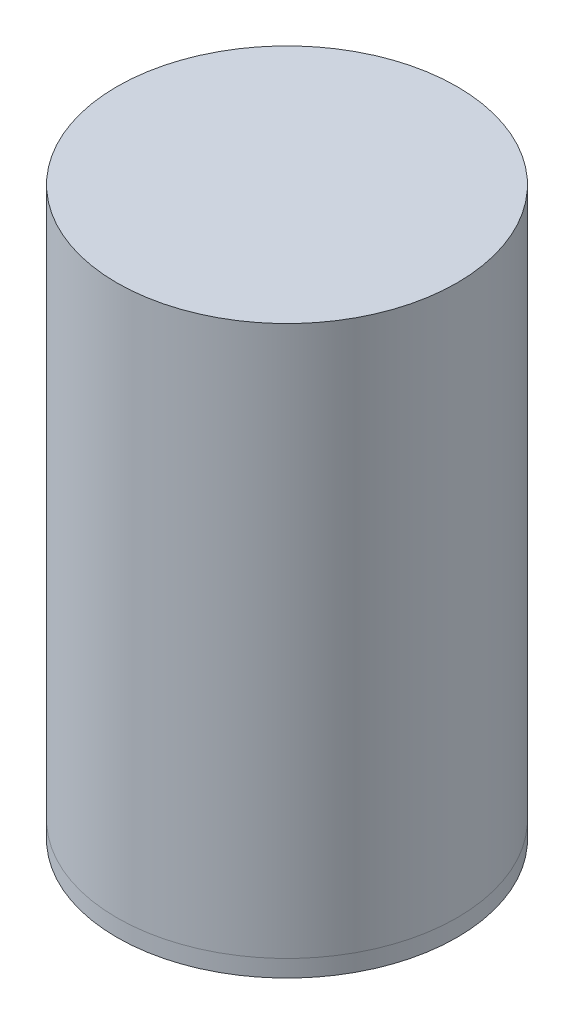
ISO-10303-21;
HEADER;
FILE_DESCRIPTION(('STEP AP214'),'2;1');
FILE_NAME('part.step','',(''),(''),'','','');
FILE_SCHEMA(('AUTOMOTIVE_DESIGN { 1 0 10303 214 1 1 1 1 }'));
ENDSEC;
DATA;
#1=APPLICATION_CONTEXT('core data for automotive mechanical design processes');
#2=APPLICATION_PROTOCOL_DEFINITION('international standard','automotive_design',2000,#1);
#3=PRODUCT_CONTEXT('',#1,'mechanical');
#4=PRODUCT('Part','Part','',(#3));
#5=PRODUCT_RELATED_PRODUCT_CATEGORY('part','',(#4));
#6=PRODUCT_DEFINITION_FORMATION('','',#4);
#7=PRODUCT_DEFINITION_CONTEXT('part definition',#1,'design');
#8=PRODUCT_DEFINITION('design','',#6,#7);
#9=PRODUCT_DEFINITION_SHAPE('','',#8);
#10=(LENGTH_UNIT() NAMED_UNIT(*) SI_UNIT(.MILLI.,.METRE.));
#11=(NAMED_UNIT(*) PLANE_ANGLE_UNIT() SI_UNIT($,.RADIAN.));
#12=(NAMED_UNIT(*) SI_UNIT($,.STERADIAN.) SOLID_ANGLE_UNIT());
#13=UNCERTAINTY_MEASURE_WITH_UNIT(LENGTH_MEASURE(1.E-05),#10,'distance_accuracy_value','');
#14=(GEOMETRIC_REPRESENTATION_CONTEXT(3) GLOBAL_UNCERTAINTY_ASSIGNED_CONTEXT((#13)) GLOBAL_UNIT_ASSIGNED_CONTEXT((#10,
#11,#12)) REPRESENTATION_CONTEXT('',''));
#15=CARTESIAN_POINT('',(0.,0.,0.));
#16=DIRECTION('',(0.,0.,1.));
#17=DIRECTION('',(1.,0.,0.));
#18=AXIS2_PLACEMENT_3D('',#15,#16,#17);
#19=CARTESIAN_POINT('',(0.,-93.,0.));
#20=DIRECTION('',(0.,-1.,0.));
#21=DIRECTION('',(1.,0.,0.));
#22=AXIS2_PLACEMENT_3D('',#19,#20,#21);
#23=CYLINDRICAL_SURFACE('',#22,18.);
#24=CARTESIAN_POINT('',(0.,-93.,0.));
#25=DIRECTION('',(0.,-1.,0.));
#26=DIRECTION('',(1.,0.,0.));
#27=AXIS2_PLACEMENT_3D('',#24,#25,#26);
#28=CIRCLE('',#27,18.);
#29=CARTESIAN_POINT('',(18.0000000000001,-93.,0.));
#30=VERTEX_POINT('',#29);
#31=EDGE_CURVE('E11',#30,#30,#28,.T.);
#32=ORIENTED_EDGE('',*,*,#31,.T.);
#33=EDGE_LOOP('',(#32));
#34=FACE_BOUND('',#33,.T.);
#35=CARTESIAN_POINT('',(1.00723583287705E-13,-94.,0.));
#36=DIRECTION('',(0.,-1.,0.));
#37=DIRECTION('',(1.,0.,0.));
#38=AXIS2_PLACEMENT_3D('',#35,#36,#37);
#39=CIRCLE('',#38,18.);
#40=CARTESIAN_POINT('',(18.0000000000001,-94.,0.));
#41=VERTEX_POINT('',#40);
#42=EDGE_CURVE('E52',#41,#41,#39,.T.);
#43=ORIENTED_EDGE('',*,*,#42,.F.);
#44=EDGE_LOOP('',(#43));
#45=FACE_BOUND('',#44,.T.);
#46=ADVANCED_FACE('F49',(#34,#45),#23,.T.);
#47=CARTESIAN_POINT('',(0.,-93.,0.));
#48=DIRECTION('',(0.,-1.,0.));
#49=DIRECTION('',(1.,0.,0.));
#50=AXIS2_PLACEMENT_3D('',#47,#48,#49);
#51=PLANE('',#50);
#52=ORIENTED_EDGE('',*,*,#31,.F.);
#53=EDGE_LOOP('',(#52));
#54=FACE_BOUND('',#53,.T.);
#55=ADVANCED_FACE('F64',(#54),#51,.F.);
#56=CARTESIAN_POINT('',(1.00723583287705E-13,-94.,0.));
#57=DIRECTION('',(0.,-1.,0.));
#58=DIRECTION('',(1.,0.,0.));
#59=AXIS2_PLACEMENT_3D('',#56,#57,#58);
#60=PLANE('',#59);
#61=ORIENTED_EDGE('',*,*,#42,.T.);
#62=EDGE_LOOP('',(#61));
#63=FACE_BOUND('',#62,.T.);
#64=ADVANCED_FACE('F61',(#63),#60,.T.);
#65=CLOSED_SHELL('',(#46,#55,#64));
#66=MANIFOLD_SOLID_BREP('B2',#65);
#67=CARTESIAN_POINT('',(0.,-91.,0.));
#68=DIRECTION('',(0.,1.,0.));
#69=DIRECTION('',(-1.,0.,0.));
#70=AXIS2_PLACEMENT_3D('',#67,#68,#69);
#71=PLANE('',#70);
#72=CARTESIAN_POINT('',(0.,-91.,0.));
#73=DIRECTION('',(0.,1.,0.));
#74=DIRECTION('',(-1.,0.,0.));
#75=AXIS2_PLACEMENT_3D('',#72,#73,#74);
#76=CIRCLE('',#75,25.);
#77=CARTESIAN_POINT('',(-24.9999999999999,-91.,0.));
#78=VERTEX_POINT('',#77);
#79=EDGE_CURVE('E48',#78,#78,#76,.T.);
#80=ORIENTED_EDGE('',*,*,#79,.T.);
#81=EDGE_LOOP('',(#80));
#82=FACE_BOUND('',#81,.T.);
#83=CARTESIAN_POINT('',(0.,-91.,0.));
#84=DIRECTION('',(0.,1.,0.));
#85=DIRECTION('',(-1.,0.,0.));
#86=AXIS2_PLACEMENT_3D('',#83,#84,#85);
#87=CIRCLE('',#86,18.);
#88=CARTESIAN_POINT('',(-17.9999999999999,-91.,0.));
#89=VERTEX_POINT('',#88);
#90=EDGE_CURVE('E108',#89,#89,#87,.T.);
#91=ORIENTED_EDGE('',*,*,#90,.F.);
#92=EDGE_LOOP('',(#91));
#93=FACE_BOUND('',#92,.T.);
#94=ADVANCED_FACE('F97',(#82,#93),#71,.T.);
#95=CARTESIAN_POINT('',(1.00723583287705E-13,-94.,0.));
#96=DIRECTION('',(0.,1.,0.));
#97=DIRECTION('',(-1.,0.,0.));
#98=AXIS2_PLACEMENT_3D('',#95,#96,#97);
#99=PLANE('',#98);
#100=CARTESIAN_POINT('',(1.00723583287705E-13,-94.,0.));
#101=DIRECTION('',(0.,1.,0.));
#102=DIRECTION('',(-1.,0.,0.));
#103=AXIS2_PLACEMENT_3D('',#100,#101,#102);
#104=CIRCLE('',#103,25.);
#105=CARTESIAN_POINT('',(-24.9999999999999,-94.,0.));
#106=VERTEX_POINT('',#105);
#107=EDGE_CURVE('E101',#106,#106,#104,.T.);
#108=ORIENTED_EDGE('',*,*,#107,.F.);
#109=EDGE_LOOP('',(#108));
#110=FACE_BOUND('',#109,.T.);
#111=CARTESIAN_POINT('',(1.00723583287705E-13,-94.,0.));
#112=DIRECTION('',(0.,1.,0.));
#113=DIRECTION('',(-1.,0.,0.));
#114=AXIS2_PLACEMENT_3D('',#111,#112,#113);
#115=CIRCLE('',#114,18.);
#116=CARTESIAN_POINT('',(-17.9999999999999,-94.,0.));
#117=VERTEX_POINT('',#116);
#118=EDGE_CURVE('E110',#117,#117,#115,.T.);
#119=ORIENTED_EDGE('',*,*,#118,.T.);
#120=EDGE_LOOP('',(#119));
#121=FACE_BOUND('',#120,.T.);
#122=ADVANCED_FACE('F120',(#110,#121),#99,.F.);
#123=CARTESIAN_POINT('',(0.,-91.,0.));
#124=DIRECTION('',(0.,-1.,0.));
#125=DIRECTION('',(1.,0.,0.));
#126=AXIS2_PLACEMENT_3D('',#123,#124,#125);
#127=CYLINDRICAL_SURFACE('',#126,25.);
#128=ORIENTED_EDGE('',*,*,#79,.F.);
#129=EDGE_LOOP('',(#128));
#130=FACE_BOUND('',#129,.T.);
#131=ORIENTED_EDGE('',*,*,#107,.T.);
#132=EDGE_LOOP('',(#131));
#133=FACE_BOUND('',#132,.T.);
#134=ADVANCED_FACE('F99',(#130,#133),#127,.T.);
#135=CARTESIAN_POINT('',(0.,-91.,0.));
#136=DIRECTION('',(0.,-1.,0.));
#137=DIRECTION('',(1.,0.,0.));
#138=AXIS2_PLACEMENT_3D('',#135,#136,#137);
#139=CYLINDRICAL_SURFACE('',#138,18.);
#140=ORIENTED_EDGE('',*,*,#90,.T.);
#141=EDGE_LOOP('',(#140));
#142=FACE_BOUND('',#141,.T.);
#143=ORIENTED_EDGE('',*,*,#118,.F.);
#144=EDGE_LOOP('',(#143));
#145=FACE_BOUND('',#144,.T.);
#146=ADVANCED_FACE('F116',(#142,#145),#139,.F.);
#147=CLOSED_SHELL('',(#94,#122,#134,#146));
#148=MANIFOLD_SOLID_BREP('B6',#147);
#149=CARTESIAN_POINT('',(0.,-94.,0.));
#150=DIRECTION('',(0.,1.,0.));
#151=DIRECTION('',(-1.,0.,0.));
#152=AXIS2_PLACEMENT_3D('',#149,#150,#151);
#153=PLANE('',#152);
#154=CARTESIAN_POINT('',(0.,-94.,0.));
#155=DIRECTION('',(0.,1.,0.));
#156=DIRECTION('',(-1.,0.,0.));
#157=AXIS2_PLACEMENT_3D('',#154,#155,#156);
#158=CIRCLE('',#157,28.535323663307);
#159=CARTESIAN_POINT('',(-28.535323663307,-94.,0.));
#160=VERTEX_POINT('',#159);
#161=EDGE_CURVE('E96',#160,#160,#158,.T.);
#162=ORIENTED_EDGE('',*,*,#161,.T.);
#163=EDGE_LOOP('',(#162));
#164=FACE_BOUND('',#163,.T.);
#165=CARTESIAN_POINT('',(0.,-94.,0.));
#166=DIRECTION('',(0.,1.,0.));
#167=DIRECTION('',(-1.,0.,0.));
#168=AXIS2_PLACEMENT_3D('',#165,#166,#167);
#169=CIRCLE('',#168,20.);
#170=CARTESIAN_POINT('',(-20.,-94.,0.));
#171=VERTEX_POINT('',#170);
#172=EDGE_CURVE('E187',#171,#171,#169,.T.);
#173=ORIENTED_EDGE('',*,*,#172,.F.);
#174=EDGE_LOOP('',(#173));
#175=FACE_BOUND('',#174,.T.);
#176=ADVANCED_FACE('F165',(#164,#175),#153,.T.);
#177=CARTESIAN_POINT('',(0.,-89.1404723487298,0.));
#178=DIRECTION('',(0.,1.,0.));
#179=DIRECTION('',(-1.,0.,0.));
#180=AXIS2_PLACEMENT_3D('',#177,#178,#179);
#181=CYLINDRICAL_SURFACE('',#180,28.535323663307);
#182=CARTESIAN_POINT('',(0.,-97.,0.));
#183=DIRECTION('',(0.,1.,0.));
#184=DIRECTION('',(-1.,0.,0.));
#185=AXIS2_PLACEMENT_3D('',#182,#183,#184);
#186=CIRCLE('',#185,28.535323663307);
#187=CARTESIAN_POINT('',(-28.535323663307,-97.,0.));
#188=VERTEX_POINT('',#187);
#189=EDGE_CURVE('E171',#188,#188,#186,.T.);
#190=ORIENTED_EDGE('',*,*,#189,.T.);
#191=EDGE_LOOP('',(#190));
#192=FACE_BOUND('',#191,.T.);
#193=ORIENTED_EDGE('',*,*,#161,.F.);
#194=EDGE_LOOP('',(#193));
#195=FACE_BOUND('',#194,.T.);
#196=ADVANCED_FACE('F195',(#192,#195),#181,.T.);
#197=CARTESIAN_POINT('',(0.,-97.,0.));
#198=DIRECTION('',(0.,1.,0.));
#199=DIRECTION('',(-1.,0.,0.));
#200=AXIS2_PLACEMENT_3D('',#197,#198,#199);
#201=PLANE('',#200);
#202=CARTESIAN_POINT('',(0.,-97.,0.));
#203=DIRECTION('',(0.,1.,0.));
#204=DIRECTION('',(-1.,0.,0.));
#205=AXIS2_PLACEMENT_3D('',#202,#203,#204);
#206=CIRCLE('',#205,30.);
#207=CARTESIAN_POINT('',(-30.,-97.,0.));
#208=VERTEX_POINT('',#207);
#209=EDGE_CURVE('E175',#208,#208,#206,.T.);
#210=ORIENTED_EDGE('',*,*,#209,.T.);
#211=EDGE_LOOP('',(#210));
#212=FACE_BOUND('',#211,.T.);
#213=ORIENTED_EDGE('',*,*,#189,.F.);
#214=EDGE_LOOP('',(#213));
#215=FACE_BOUND('',#214,.T.);
#216=ADVANCED_FACE('F199',(#212,#215),#201,.T.);
#217=CARTESIAN_POINT('',(0.,-89.1404723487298,0.));
#218=DIRECTION('',(0.,1.,0.));
#219=DIRECTION('',(-1.,0.,0.));
#220=AXIS2_PLACEMENT_3D('',#217,#218,#219);
#221=CYLINDRICAL_SURFACE('',#220,30.);
#222=ORIENTED_EDGE('',*,*,#209,.F.);
#223=EDGE_LOOP('',(#222));
#224=FACE_BOUND('',#223,.T.);
#225=CARTESIAN_POINT('',(0.,-100.,0.));
#226=DIRECTION('',(0.,1.,0.));
#227=DIRECTION('',(-1.,0.,0.));
#228=AXIS2_PLACEMENT_3D('',#225,#226,#227);
#229=CIRCLE('',#228,30.);
#230=CARTESIAN_POINT('',(-30.,-100.,0.));
#231=VERTEX_POINT('',#230);
#232=EDGE_CURVE('E179',#231,#231,#229,.T.);
#233=ORIENTED_EDGE('',*,*,#232,.T.);
#234=EDGE_LOOP('',(#233));
#235=FACE_BOUND('',#234,.T.);
#236=ADVANCED_FACE('F203',(#224,#235),#221,.T.);
#237=CARTESIAN_POINT('',(0.,-100.,0.));
#238=DIRECTION('',(0.,1.,0.));
#239=DIRECTION('',(-1.,0.,0.));
#240=AXIS2_PLACEMENT_3D('',#237,#238,#239);
#241=PLANE('',#240);
#242=ORIENTED_EDGE('',*,*,#232,.F.);
#243=EDGE_LOOP('',(#242));
#244=FACE_BOUND('',#243,.T.);
#245=CARTESIAN_POINT('',(0.,-100.,0.));
#246=DIRECTION('',(0.,1.,0.));
#247=DIRECTION('',(-1.,0.,0.));
#248=AXIS2_PLACEMENT_3D('',#245,#246,#247);
#249=CIRCLE('',#248,26.);
#250=CARTESIAN_POINT('',(-26.,-100.,0.));
#251=VERTEX_POINT('',#250);
#252=EDGE_CURVE('E184',#251,#251,#249,.T.);
#253=ORIENTED_EDGE('',*,*,#252,.T.);
#254=EDGE_LOOP('',(#253));
#255=FACE_BOUND('',#254,.T.);
#256=ADVANCED_FACE('F210',(#244,#255),#241,.F.);
#257=CARTESIAN_POINT('',(0.,-100.,0.));
#258=DIRECTION('',(0.,-1.,0.));
#259=DIRECTION('',(1.,0.,0.));
#260=AXIS2_PLACEMENT_3D('',#257,#258,#259);
#261=CONICAL_SURFACE('',#260,26.,0.785398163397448);
#262=ORIENTED_EDGE('',*,*,#172,.T.);
#263=EDGE_LOOP('',(#262));
#264=FACE_BOUND('',#263,.T.);
#265=ORIENTED_EDGE('',*,*,#252,.F.);
#266=EDGE_LOOP('',(#265));
#267=FACE_BOUND('',#266,.T.);
#268=ADVANCED_FACE('F191',(#264,#267),#261,.F.);
#269=CLOSED_SHELL('',(#176,#196,#216,#236,#256,#268));
#270=MANIFOLD_SOLID_BREP('B43',#269);
#271=CARTESIAN_POINT('',(0.,-97.,0.));
#272=DIRECTION('',(0.,1.,0.));
#273=DIRECTION('',(0.,0.,1.));
#274=AXIS2_PLACEMENT_3D('',#271,#272,#273);
#275=CYLINDRICAL_SURFACE('',#274,30.);
#276=CARTESIAN_POINT('',(0.,-97.,0.));
#277=DIRECTION('',(0.,1.,0.));
#278=DIRECTION('',(0.,0.,1.));
#279=AXIS2_PLACEMENT_3D('',#276,#277,#278);
#280=CIRCLE('',#279,30.);
#281=CARTESIAN_POINT('',(0.,-97.,30.));
#282=VERTEX_POINT('',#281);
#283=EDGE_CURVE('E164',#282,#282,#280,.T.);
#284=CARTESIAN_POINT('',(0.,0.,0.));
#285=DIRECTION('',(0.,1.,0.));
#286=DIRECTION('',(0.,0.,1.));
#287=AXIS2_PLACEMENT_3D('',#284,#285,#286);
#288=CIRCLE('',#287,30.);
#289=CARTESIAN_POINT('',(0.,0.,30.));
#290=VERTEX_POINT('',#289);
#291=EDGE_CURVE('E263',#290,#290,#288,.T.);
#292=CARTESIAN_POINT('',(0.,-97.,30.));
#293=CARTESIAN_POINT('',(0.,-95.9895833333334,30.));
#294=CARTESIAN_POINT('',(0.,-94.9791666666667,30.));
#295=CARTESIAN_POINT('',(0.,-92.9583333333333,30.));
#296=CARTESIAN_POINT('',(0.,-91.9479166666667,30.));
#297=CARTESIAN_POINT('',(0.,-89.9270833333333,30.));
#298=CARTESIAN_POINT('',(0.,-88.9166666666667,30.));
#299=CARTESIAN_POINT('',(0.,-86.8958333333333,30.));
#300=CARTESIAN_POINT('',(0.,-85.8854166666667,30.));
#301=CARTESIAN_POINT('',(0.,-83.8645833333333,30.));
#302=CARTESIAN_POINT('',(0.,-82.8541666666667,30.));
#303=CARTESIAN_POINT('',(0.,-80.8333333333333,30.));
#304=CARTESIAN_POINT('',(0.,-79.8229166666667,30.));
#305=CARTESIAN_POINT('',(0.,-77.8020833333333,30.));
#306=CARTESIAN_POINT('',(0.,-76.7916666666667,30.));
#307=CARTESIAN_POINT('',(0.,-74.7708333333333,30.));
#308=CARTESIAN_POINT('',(0.,-73.7604166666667,30.));
#309=CARTESIAN_POINT('',(0.,-71.7395833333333,30.));
#310=CARTESIAN_POINT('',(0.,-70.7291666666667,30.));
#311=CARTESIAN_POINT('',(0.,-68.7083333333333,30.));
#312=CARTESIAN_POINT('',(0.,-67.6979166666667,30.));
#313=CARTESIAN_POINT('',(0.,-65.6770833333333,30.));
#314=CARTESIAN_POINT('',(0.,-64.6666666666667,30.));
#315=CARTESIAN_POINT('',(0.,-62.6458333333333,30.));
#316=CARTESIAN_POINT('',(0.,-61.6354166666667,30.));
#317=CARTESIAN_POINT('',(0.,-59.6145833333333,30.));
#318=CARTESIAN_POINT('',(0.,-58.6041666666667,30.));
#319=CARTESIAN_POINT('',(0.,-56.5833333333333,30.));
#320=CARTESIAN_POINT('',(0.,-55.5729166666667,30.));
#321=CARTESIAN_POINT('',(0.,-53.5520833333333,30.));
#322=CARTESIAN_POINT('',(0.,-52.5416666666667,30.));
#323=CARTESIAN_POINT('',(0.,-50.5208333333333,30.));
#324=CARTESIAN_POINT('',(0.,-49.5104166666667,30.));
#325=CARTESIAN_POINT('',(0.,-47.4895833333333,30.));
#326=CARTESIAN_POINT('',(0.,-46.4791666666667,30.));
#327=CARTESIAN_POINT('',(0.,-44.4583333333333,30.));
#328=CARTESIAN_POINT('',(0.,-43.4479166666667,30.));
#329=CARTESIAN_POINT('',(0.,-41.4270833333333,30.));
#330=CARTESIAN_POINT('',(0.,-40.4166666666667,30.));
#331=CARTESIAN_POINT('',(0.,-38.3958333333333,30.));
#332=CARTESIAN_POINT('',(0.,-37.3854166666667,30.));
#333=CARTESIAN_POINT('',(0.,-35.3645833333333,30.));
#334=CARTESIAN_POINT('',(0.,-34.3541666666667,30.));
#335=CARTESIAN_POINT('',(0.,-32.3333333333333,30.));
#336=CARTESIAN_POINT('',(0.,-31.3229166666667,30.));
#337=CARTESIAN_POINT('',(0.,-29.3020833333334,30.));
#338=CARTESIAN_POINT('',(0.,-28.2916666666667,30.));
#339=CARTESIAN_POINT('',(0.,-26.2708333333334,30.));
#340=CARTESIAN_POINT('',(0.,-25.2604166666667,30.));
#341=CARTESIAN_POINT('',(0.,-23.2395833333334,30.));
#342=CARTESIAN_POINT('',(0.,-22.2291666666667,30.));
#343=CARTESIAN_POINT('',(0.,-20.2083333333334,30.));
#344=CARTESIAN_POINT('',(0.,-19.1979166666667,30.));
#345=CARTESIAN_POINT('',(0.,-17.1770833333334,30.));
#346=CARTESIAN_POINT('',(0.,-16.1666666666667,30.));
#347=CARTESIAN_POINT('',(0.,-14.1458333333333,30.));
#348=CARTESIAN_POINT('',(0.,-13.1354166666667,30.));
#349=CARTESIAN_POINT('',(0.,-11.1145833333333,30.));
#350=CARTESIAN_POINT('',(0.,-10.1041666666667,30.));
#351=CARTESIAN_POINT('',(0.,-8.08333333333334,30.));
#352=CARTESIAN_POINT('',(0.,-7.07291666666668,30.));
#353=CARTESIAN_POINT('',(0.,-5.05208333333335,30.));
#354=CARTESIAN_POINT('',(0.,-4.04166666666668,30.));
#355=CARTESIAN_POINT('',(0.,-2.02083333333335,30.));
#356=CARTESIAN_POINT('',(0.,-1.01041666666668,30.));
#357=CARTESIAN_POINT('',(0.,0.,30.));
#358=B_SPLINE_CURVE_WITH_KNOTS('',3,(#292,#293,#294,#295,#296,#297,#298,#299,#300,#301,#302,
#303,#304,#305,#306,#307,#308,#309,#310,#311,#312,#313,#314,#315,#316,#317,#318,#319,#320,#321,
#322,#323,#324,#325,#326,#327,#328,#329,#330,#331,#332,#333,#334,#335,#336,#337,#338,#339,#340,
#341,#342,#343,#344,#345,#346,#347,#348,#349,#350,#351,#352,#353,#354,#355,#356,#357),
.UNSPECIFIED.,.F.,.F.,(4,2,2,2,2,2,2,2,2,2,2,2,2,2,2,2,2,2,2,2,2,2,2,2,2,2,2,2,2,2,2,2,4),(0.,
3.03125000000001,6.06250000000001,9.09375000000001,12.125,15.15625,18.1875,21.21875,24.25,
27.28125,30.3125,33.34375,36.375,39.40625,42.4375,45.46875,48.5,51.53125,54.5625,57.59375,
60.625,63.65625,66.6875,69.71875,72.75,75.78125,78.8125,81.84375,84.875,87.90625,90.9375,
93.96875,97.),.UNSPECIFIED.);
#359=EDGE_CURVE('BSEAM260',#282,#290,#358,.T.);
#360=ORIENTED_EDGE('',*,*,#283,.T.);
#361=ORIENTED_EDGE('',*,*,#291,.F.);
#362=ORIENTED_EDGE('',*,*,#359,.T.);
#363=ORIENTED_EDGE('',*,*,#359,.F.);
#364=EDGE_LOOP('',(#360,#362,#361,#363));
#365=FACE_BOUND('',#364,.T.);
#366=ADVANCED_FACE('F260',(#365),#275,.T.);
#367=CARTESIAN_POINT('',(0.,-97.,0.));
#368=DIRECTION('',(0.,1.,0.));
#369=DIRECTION('',(0.,0.,1.));
#370=AXIS2_PLACEMENT_3D('',#367,#368,#369);
#371=PLANE('',#370);
#372=CARTESIAN_POINT('',(0.,-97.,0.));
#373=DIRECTION('',(0.,1.,0.));
#374=DIRECTION('',(0.,0.,1.));
#375=AXIS2_PLACEMENT_3D('',#372,#373,#374);
#376=CIRCLE('',#375,28.5);
#377=CARTESIAN_POINT('',(0.,-97.,28.5));
#378=VERTEX_POINT('',#377);
#379=EDGE_CURVE('E272',#378,#378,#376,.T.);
#380=ORIENTED_EDGE('',*,*,#379,.T.);
#381=EDGE_LOOP('',(#380));
#382=FACE_BOUND('',#381,.T.);
#383=ORIENTED_EDGE('',*,*,#283,.F.);
#384=EDGE_LOOP('',(#383));
#385=FACE_BOUND('',#384,.T.);
#386=ADVANCED_FACE('F295',(#382,#385),#371,.F.);
#387=CARTESIAN_POINT('',(0.,0.,0.));
#388=DIRECTION('',(0.,1.,0.));
#389=DIRECTION('',(0.,0.,1.));
#390=AXIS2_PLACEMENT_3D('',#387,#388,#389);
#391=PLANE('',#390);
#392=ORIENTED_EDGE('',*,*,#291,.T.);
#393=EDGE_LOOP('',(#392));
#394=FACE_BOUND('',#393,.T.);
#395=ADVANCED_FACE('F290',(#394),#391,.T.);
#396=CARTESIAN_POINT('',(0.,-97.,0.));
#397=DIRECTION('',(0.,1.,0.));
#398=DIRECTION('',(0.,0.,1.));
#399=AXIS2_PLACEMENT_3D('',#396,#397,#398);
#400=CYLINDRICAL_SURFACE('',#399,28.5);
#401=CARTESIAN_POINT('',(0.,-1.5,0.));
#402=DIRECTION('',(0.,1.,0.));
#403=DIRECTION('',(0.,0.,1.));
#404=AXIS2_PLACEMENT_3D('',#401,#402,#403);
#405=CIRCLE('',#404,28.5);
#406=CARTESIAN_POINT('',(0.,-1.50000000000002,28.5));
#407=VERTEX_POINT('',#406);
#408=EDGE_CURVE('E277',#407,#407,#405,.T.);
#409=CARTESIAN_POINT('',(0.,-97.,28.5));
#410=CARTESIAN_POINT('',(0.,-96.0052083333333,28.5));
#411=CARTESIAN_POINT('',(0.,-95.0104166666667,28.5));
#412=CARTESIAN_POINT('',(0.,-93.0208333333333,28.5));
#413=CARTESIAN_POINT('',(0.,-92.0260416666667,28.5));
#414=CARTESIAN_POINT('',(0.,-90.0364583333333,28.5));
#415=CARTESIAN_POINT('',(0.,-89.0416666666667,28.5));
#416=CARTESIAN_POINT('',(0.,-87.0520833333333,28.5));
#417=CARTESIAN_POINT('',(0.,-86.0572916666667,28.5));
#418=CARTESIAN_POINT('',(0.,-84.0677083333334,28.5));
#419=CARTESIAN_POINT('',(0.,-83.0729166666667,28.5));
#420=CARTESIAN_POINT('',(0.,-81.0833333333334,28.5));
#421=CARTESIAN_POINT('',(0.,-80.0885416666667,28.5));
#422=CARTESIAN_POINT('',(0.,-78.0989583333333,28.5));
#423=CARTESIAN_POINT('',(0.,-77.1041666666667,28.5));
#424=CARTESIAN_POINT('',(0.,-75.1145833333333,28.5));
#425=CARTESIAN_POINT('',(0.,-74.1197916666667,28.5));
#426=CARTESIAN_POINT('',(0.,-72.1302083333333,28.5));
#427=CARTESIAN_POINT('',(0.,-71.1354166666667,28.5));
#428=CARTESIAN_POINT('',(0.,-69.1458333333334,28.5));
#429=CARTESIAN_POINT('',(0.,-68.1510416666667,28.5));
#430=CARTESIAN_POINT('',(0.,-66.1614583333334,28.5));
#431=CARTESIAN_POINT('',(0.,-65.1666666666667,28.5));
#432=CARTESIAN_POINT('',(0.,-63.1770833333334,28.5));
#433=CARTESIAN_POINT('',(0.,-62.1822916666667,28.5));
#434=CARTESIAN_POINT('',(0.,-60.1927083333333,28.5));
#435=CARTESIAN_POINT('',(0.,-59.1979166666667,28.5));
#436=CARTESIAN_POINT('',(0.,-57.2083333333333,28.5));
#437=CARTESIAN_POINT('',(0.,-56.2135416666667,28.5));
#438=CARTESIAN_POINT('',(0.,-54.2239583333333,28.5));
#439=CARTESIAN_POINT('',(0.,-53.2291666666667,28.5));
#440=CARTESIAN_POINT('',(0.,-51.2395833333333,28.5));
#441=CARTESIAN_POINT('',(0.,-50.2447916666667,28.5));
#442=CARTESIAN_POINT('',(0.,-48.2552083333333,28.5));
#443=CARTESIAN_POINT('',(0.,-47.2604166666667,28.5));
#444=CARTESIAN_POINT('',(0.,-45.2708333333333,28.5));
#445=CARTESIAN_POINT('',(0.,-44.2760416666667,28.5));
#446=CARTESIAN_POINT('',(0.,-42.2864583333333,28.5));
#447=CARTESIAN_POINT('',(0.,-41.2916666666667,28.5));
#448=CARTESIAN_POINT('',(0.,-39.3020833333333,28.5));
#449=CARTESIAN_POINT('',(0.,-38.3072916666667,28.5));
#450=CARTESIAN_POINT('',(0.,-36.3177083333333,28.5));
#451=CARTESIAN_POINT('',(0.,-35.3229166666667,28.5));
#452=CARTESIAN_POINT('',(0.,-33.3333333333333,28.5));
#453=CARTESIAN_POINT('',(0.,-32.3385416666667,28.5));
#454=CARTESIAN_POINT('',(0.,-30.3489583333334,28.5));
#455=CARTESIAN_POINT('',(0.,-29.3541666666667,28.5));
#456=CARTESIAN_POINT('',(0.,-27.3645833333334,28.5));
#457=CARTESIAN_POINT('',(0.,-26.3697916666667,28.5));
#458=CARTESIAN_POINT('',(0.,-24.3802083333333,28.5));
#459=CARTESIAN_POINT('',(0.,-23.3854166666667,28.5));
#460=CARTESIAN_POINT('',(0.,-21.3958333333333,28.5));
#461=CARTESIAN_POINT('',(0.,-20.4010416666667,28.5));
#462=CARTESIAN_POINT('',(0.,-18.4114583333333,28.5));
#463=CARTESIAN_POINT('',(0.,-17.4166666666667,28.5));
#464=CARTESIAN_POINT('',(0.,-15.4270833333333,28.5));
#465=CARTESIAN_POINT('',(0.,-14.4322916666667,28.5));
#466=CARTESIAN_POINT('',(0.,-12.4427083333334,28.5));
#467=CARTESIAN_POINT('',(0.,-11.4479166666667,28.5));
#468=CARTESIAN_POINT('',(0.,-9.45833333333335,28.5));
#469=CARTESIAN_POINT('',(0.,-8.46354166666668,28.5));
#470=CARTESIAN_POINT('',(0.,-6.47395833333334,28.5));
#471=CARTESIAN_POINT('',(0.,-5.47916666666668,28.5));
#472=CARTESIAN_POINT('',(0.,-3.48958333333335,28.5));
#473=CARTESIAN_POINT('',(0.,-2.49479166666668,28.5));
#474=CARTESIAN_POINT('',(0.,-1.50000000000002,28.5));
#475=B_SPLINE_CURVE_WITH_KNOTS('',3,(#409,#410,#411,#412,#413,#414,#415,#416,#417,#418,#419,
#420,#421,#422,#423,#424,#425,#426,#427,#428,#429,#430,#431,#432,#433,#434,#435,#436,#437,#438,
#439,#440,#441,#442,#443,#444,#445,#446,#447,#448,#449,#450,#451,#452,#453,#454,#455,#456,#457,
#458,#459,#460,#461,#462,#463,#464,#465,#466,#467,#468,#469,#470,#471,#472,#473,#474),
.UNSPECIFIED.,.F.,.F.,(4,2,2,2,2,2,2,2,2,2,2,2,2,2,2,2,2,2,2,2,2,2,2,2,2,2,2,2,2,2,2,2,4),(0.,
2.984375,5.96874999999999,8.95312499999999,11.9375,14.921875,17.90625,20.890625,23.875,
26.859375,29.84375,32.828125,35.8125,38.796875,41.78125,44.765625,47.75,50.734375,53.71875,
56.703125,59.6875,62.671875,65.65625,68.640625,71.625,74.609375,77.59375,80.578125,83.5625,
86.546875,89.53125,92.515625,95.5),.UNSPECIFIED.);
#476=EDGE_CURVE('BSEAM282',#378,#407,#475,.T.);
#477=ORIENTED_EDGE('',*,*,#379,.F.);
#478=ORIENTED_EDGE('',*,*,#408,.T.);
#479=ORIENTED_EDGE('',*,*,#476,.T.);
#480=ORIENTED_EDGE('',*,*,#476,.F.);
#481=EDGE_LOOP('',(#477,#479,#478,#480));
#482=FACE_BOUND('',#481,.T.);
#483=ADVANCED_FACE('F282',(#482),#400,.F.);
#484=CARTESIAN_POINT('',(0.,-1.5,0.));
#485=DIRECTION('',(0.,1.,0.));
#486=DIRECTION('',(0.,0.,1.));
#487=AXIS2_PLACEMENT_3D('',#484,#485,#486);
#488=PLANE('',#487);
#489=ORIENTED_EDGE('',*,*,#408,.F.);
#490=EDGE_LOOP('',(#489));
#491=FACE_BOUND('',#490,.T.);
#492=ADVANCED_FACE('F284',(#491),#488,.F.);
#493=CLOSED_SHELL('',(#366,#386,#395,#483,#492));
#494=MANIFOLD_SOLID_BREP('B91',#493);
#495=ADVANCED_BREP_SHAPE_REPRESENTATION('',(#18,#66,#148,#270,#494),#14);
#496=SHAPE_DEFINITION_REPRESENTATION(#9,#495);
ENDSEC;
END-ISO-10303-21;
